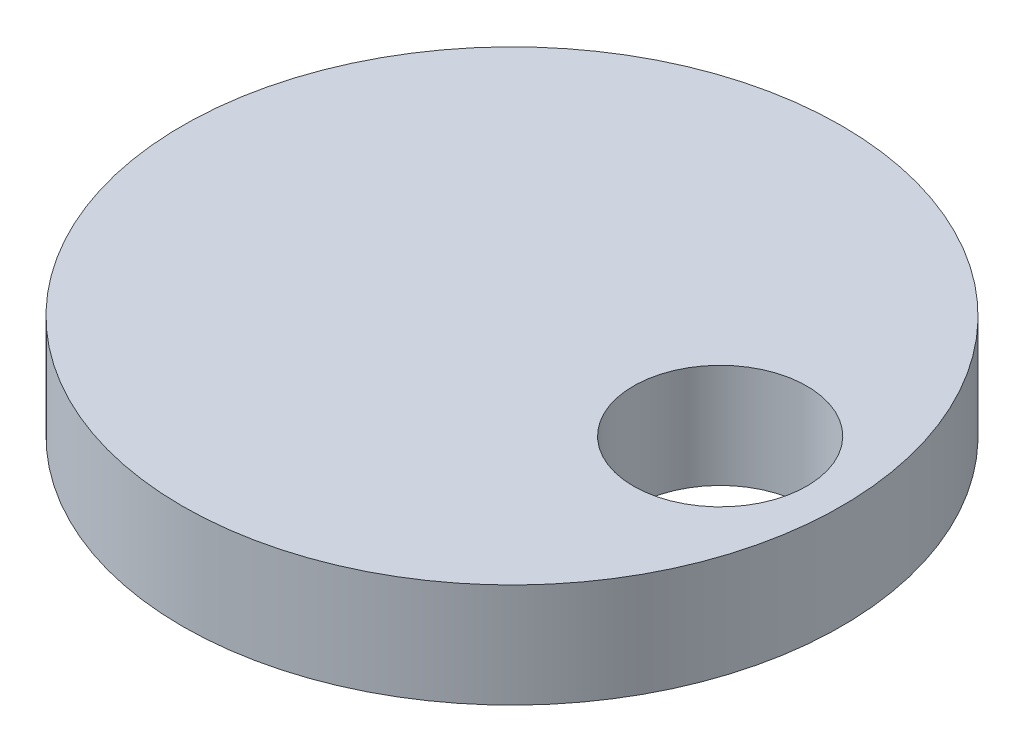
ISO-10303-21;
HEADER;
FILE_DESCRIPTION(('STEP AP214'),'2;1');
FILE_NAME('part.step','',(''),(''),'','','');
FILE_SCHEMA(('AUTOMOTIVE_DESIGN { 1 0 10303 214 1 1 1 1 }'));
ENDSEC;
DATA;
#1=APPLICATION_CONTEXT('core data for automotive mechanical design processes');
#2=APPLICATION_PROTOCOL_DEFINITION('international standard','automotive_design',2000,#1);
#3=PRODUCT_CONTEXT('',#1,'mechanical');
#4=PRODUCT('Part','Part','',(#3));
#5=PRODUCT_RELATED_PRODUCT_CATEGORY('part','',(#4));
#6=PRODUCT_DEFINITION_FORMATION('','',#4);
#7=PRODUCT_DEFINITION_CONTEXT('part definition',#1,'design');
#8=PRODUCT_DEFINITION('design','',#6,#7);
#9=PRODUCT_DEFINITION_SHAPE('','',#8);
#10=(LENGTH_UNIT() NAMED_UNIT(*) SI_UNIT(.MILLI.,.METRE.));
#11=(NAMED_UNIT(*) PLANE_ANGLE_UNIT() SI_UNIT($,.RADIAN.));
#12=(NAMED_UNIT(*) SI_UNIT($,.STERADIAN.) SOLID_ANGLE_UNIT());
#13=UNCERTAINTY_MEASURE_WITH_UNIT(LENGTH_MEASURE(1.E-05),#10,'distance_accuracy_value','');
#14=(GEOMETRIC_REPRESENTATION_CONTEXT(3) GLOBAL_UNCERTAINTY_ASSIGNED_CONTEXT((#13)) GLOBAL_UNIT_ASSIGNED_CONTEXT((#10,
#11,#12)) REPRESENTATION_CONTEXT('',''));
#15=CARTESIAN_POINT('',(0.,0.,0.));
#16=DIRECTION('',(0.,0.,1.));
#17=DIRECTION('',(1.,0.,0.));
#18=AXIS2_PLACEMENT_3D('',#15,#16,#17);
#19=CARTESIAN_POINT('',(0.,3.,0.));
#20=DIRECTION('',(0.,-1.,0.));
#21=DIRECTION('',(0.,0.,-1.));
#22=AXIS2_PLACEMENT_3D('',#19,#20,#21);
#23=CYLINDRICAL_SURFACE('',#22,9.5);
#24=CARTESIAN_POINT('',(0.,3.,0.));
#25=DIRECTION('',(0.,1.,0.));
#26=DIRECTION('',(0.,0.,1.));
#27=AXIS2_PLACEMENT_3D('',#24,#25,#26);
#28=CIRCLE('',#27,9.5);
#29=CARTESIAN_POINT('',(0.,3.,9.5));
#30=VERTEX_POINT('',#29);
#31=EDGE_CURVE('E10',#30,#30,#28,.T.);
#32=ORIENTED_EDGE('',*,*,#31,.F.);
#33=EDGE_LOOP('',(#32));
#34=FACE_BOUND('',#33,.T.);
#35=CARTESIAN_POINT('',(0.,0.,0.));
#36=DIRECTION('',(0.,1.,0.));
#37=DIRECTION('',(0.,0.,1.));
#38=AXIS2_PLACEMENT_3D('',#35,#36,#37);
#39=CIRCLE('',#38,9.5);
#40=CARTESIAN_POINT('',(0.,0.,9.5));
#41=VERTEX_POINT('',#40);
#42=EDGE_CURVE('E34',#41,#41,#39,.T.);
#43=ORIENTED_EDGE('',*,*,#42,.T.);
#44=EDGE_LOOP('',(#43));
#45=FACE_BOUND('',#44,.T.);
#46=ADVANCED_FACE('F31',(#34,#45),#23,.T.);
#47=CARTESIAN_POINT('',(0.,3.,0.));
#48=DIRECTION('',(0.,1.,0.));
#49=DIRECTION('',(0.,0.,1.));
#50=AXIS2_PLACEMENT_3D('',#47,#48,#49);
#51=PLANE('',#50);
#52=CARTESIAN_POINT('',(6.,3.,0.));
#53=DIRECTION('',(0.,1.,0.));
#54=DIRECTION('',(0.,0.,1.));
#55=AXIS2_PLACEMENT_3D('',#52,#53,#54);
#56=CIRCLE('',#55,2.49999999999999);
#57=CARTESIAN_POINT('',(6.,3.,2.49999999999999));
#58=VERTEX_POINT('',#57);
#59=EDGE_CURVE('E45',#58,#58,#56,.T.);
#60=ORIENTED_EDGE('',*,*,#59,.F.);
#61=EDGE_LOOP('',(#60));
#62=FACE_BOUND('',#61,.T.);
#63=ORIENTED_EDGE('',*,*,#31,.T.);
#64=EDGE_LOOP('',(#63));
#65=FACE_BOUND('',#64,.T.);
#66=ADVANCED_FACE('F51',(#62,#65),#51,.T.);
#67=CARTESIAN_POINT('',(0.,0.,0.));
#68=DIRECTION('',(0.,1.,0.));
#69=DIRECTION('',(0.,0.,1.));
#70=AXIS2_PLACEMENT_3D('',#67,#68,#69);
#71=PLANE('',#70);
#72=CARTESIAN_POINT('',(6.,0.,0.));
#73=DIRECTION('',(0.,1.,0.));
#74=DIRECTION('',(0.,0.,1.));
#75=AXIS2_PLACEMENT_3D('',#72,#73,#74);
#76=CIRCLE('',#75,2.5);
#77=CARTESIAN_POINT('',(6.,0.,2.5));
#78=VERTEX_POINT('',#77);
#79=EDGE_CURVE('E41',#78,#78,#76,.T.);
#80=ORIENTED_EDGE('',*,*,#79,.T.);
#81=EDGE_LOOP('',(#80));
#82=FACE_BOUND('',#81,.T.);
#83=ORIENTED_EDGE('',*,*,#42,.F.);
#84=EDGE_LOOP('',(#83));
#85=FACE_BOUND('',#84,.T.);
#86=ADVANCED_FACE('F53',(#82,#85),#71,.F.);
#87=CARTESIAN_POINT('',(6.,3.,0.));
#88=DIRECTION('',(0.,1.,0.));
#89=DIRECTION('',(0.,0.,1.));
#90=AXIS2_PLACEMENT_3D('',#87,#88,#89);
#91=CYLINDRICAL_SURFACE('',#90,2.49999999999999);
#92=ORIENTED_EDGE('',*,*,#79,.F.);
#93=EDGE_LOOP('',(#92));
#94=FACE_BOUND('',#93,.T.);
#95=ORIENTED_EDGE('',*,*,#59,.T.);
#96=EDGE_LOOP('',(#95));
#97=FACE_BOUND('',#96,.T.);
#98=ADVANCED_FACE('F49',(#94,#97),#91,.F.);
#99=CLOSED_SHELL('',(#46,#66,#86,#98));
#100=MANIFOLD_SOLID_BREP('B2',#99);
#101=ADVANCED_BREP_SHAPE_REPRESENTATION('',(#18,#100),#14);
#102=SHAPE_DEFINITION_REPRESENTATION(#9,#101);
ENDSEC;
END-ISO-10303-21;
